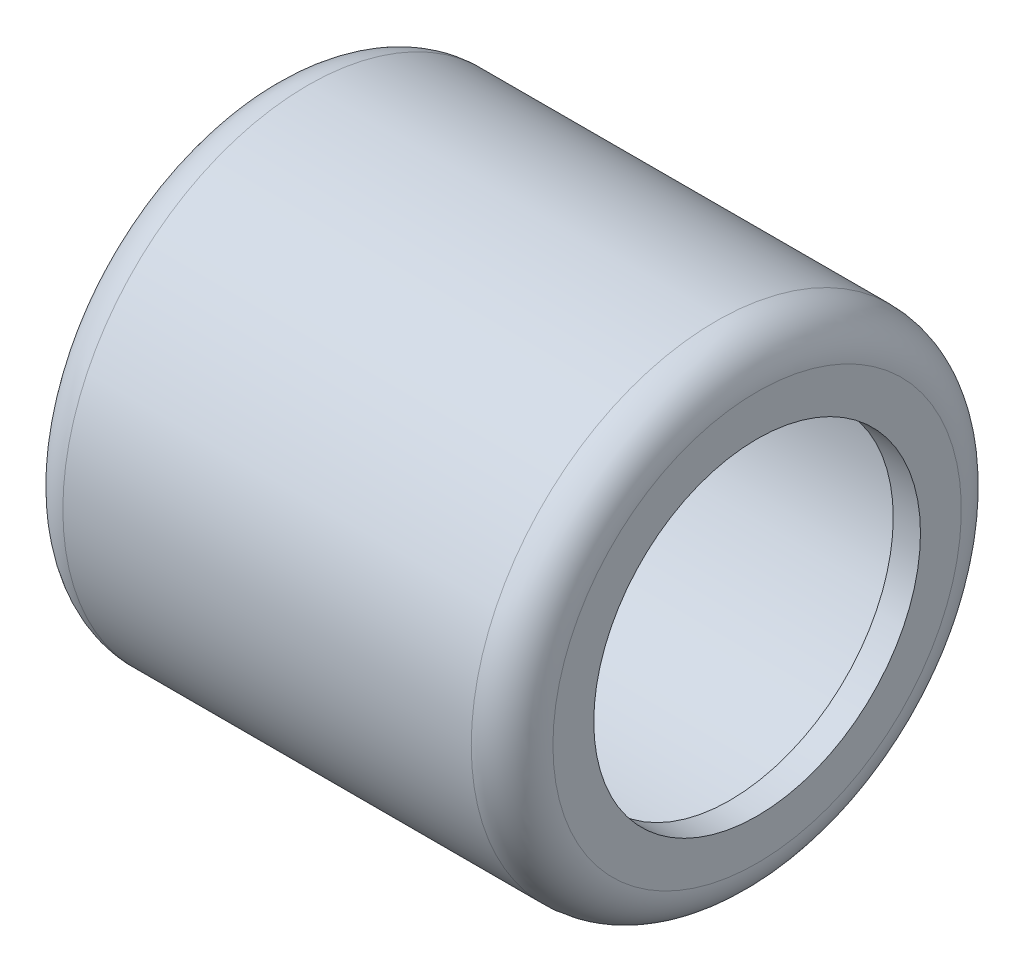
from build123d import *

# Parameters (mm, degrees)
CONG_1_R = 0.75
CONG_2_R = 0.25


with BuildPart() as part:
    # Esquisse1 → Base-R_volution (revolve)
    with BuildSketch(Plane(origin=(0, 0, 0), x_dir=(1, 0, 0), z_dir=(0, 1, 0)), mode=Mode.PRIVATE) as base_r_volution_sk:
        Polygon((-4.5, 4.5), (4.5, 4.5), (4.5, 3), (4, 3), (4, 4), (-4, 4), (-4, 3), (-4.5, 3), align=None)
    revolve(base_r_volution_sk.sketch.rotate(Axis((0, 0, 0), (1, 0, 0)), 180), axis=Axis((0, 0, 0), (1, 0, 0)))

    # Cong_1
    cong_1_edges = [part.edges().sort_by_distance(p)[0] for p in [
        (-4.5, 0, -4.5),
        (4.5, 0, -4.5),
    ]]
    fillet(cong_1_edges, radius=CONG_1_R)

    # Cong_2
    cong_2_edges = [part.edges().sort_by_distance(p)[0] for p in [
        (-4, 0, -4),
        (4, 0, -4),
    ]]
    fillet(cong_2_edges, radius=CONG_2_R)


solid = part.part
